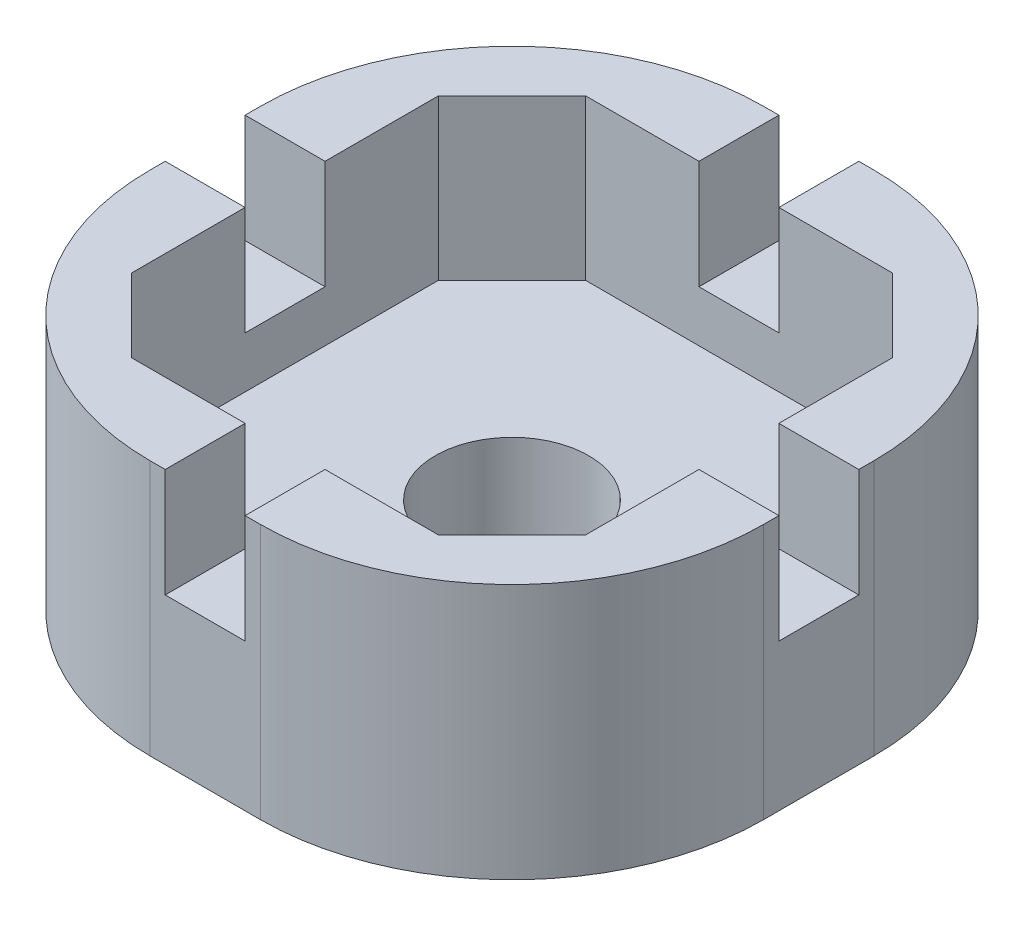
from build123d import *

# Parameters (mm, degrees)
SKETCH1_W           = 24.384
SKETCH1_H           = 24.384
BOSS_EXTRUDE1_DEPTH = 6.35
SKETCH2_W           = 24.384
SKETCH2_H           = 24.384
SKETCH2_R           = 3.048
BOSS_EXTRUDE2_DEPTH = 3.81
SKETCH3_W           = 3.175
SKETCH3_H           = 3.175
CUT_EXTRUDE1_DEPTH  = 4.318
FILLET1_R           = 10


with BuildPart() as part:
    # Sketch1 → Boss-Extrude1 (new body)
    with BuildSketch(Plane(origin=(0, 0, 0), x_dir=(1, 0, 0), z_dir=(0, 1, 0))):
        Rectangle(SKETCH1_W, SKETCH1_H)
        Polygon((-6.096, 9.017), (6.096, 9.017), (9.017, 6.096), (9.017, -6.096), (6.096, -9.017), (-6.096, -9.017), (-9.017, -6.096), (-9.017, 6.096), align=None, mode=Mode.SUBTRACT)
    extrude(amount=BOSS_EXTRUDE1_DEPTH)

    # Sketch2 → Boss-Extrude2 (add)
    with BuildSketch(Plane.XZ):
        Rectangle(SKETCH2_W, SKETCH2_H)
        with Locations(Location((0, 0, 0), (0, 0, 90))):
            Circle(SKETCH2_R, mode=Mode.SUBTRACT)
    extrude(amount=BOSS_EXTRUDE2_DEPTH)

    # Sketch3 → Cut-Extrude1 (cut)
    with BuildSketch(Plane(origin=(0, 6.35, 0), x_dir=(1, 0, 0), z_dir=(0, 1, 0))):
        with Locations((0, -10.6045)):
            Rectangle(SKETCH3_W, SKETCH3_H)
        with Locations((10.6045, 0)):
            Rectangle(SKETCH3_W, SKETCH3_H)
        with Locations((-10.6045, 0)):
            Rectangle(SKETCH3_W, SKETCH3_H)
        with Locations((0, 10.6045)):
            Rectangle(SKETCH3_W, SKETCH3_H)
    extrude(amount=-CUT_EXTRUDE1_DEPTH, mode=Mode.SUBTRACT)

    # Fillet1
    fillet1_edges = [part.edges().sort_by_distance(p)[0] for p in [
        (-12.192, 1.27, 12.192),
        (-12.192, 1.27, -12.192),
        (12.192, 1.27, -12.192),
        (12.192, 1.27, 12.192),
    ]]
    fillet(fillet1_edges, radius=FILLET1_R)


solid = part.part
